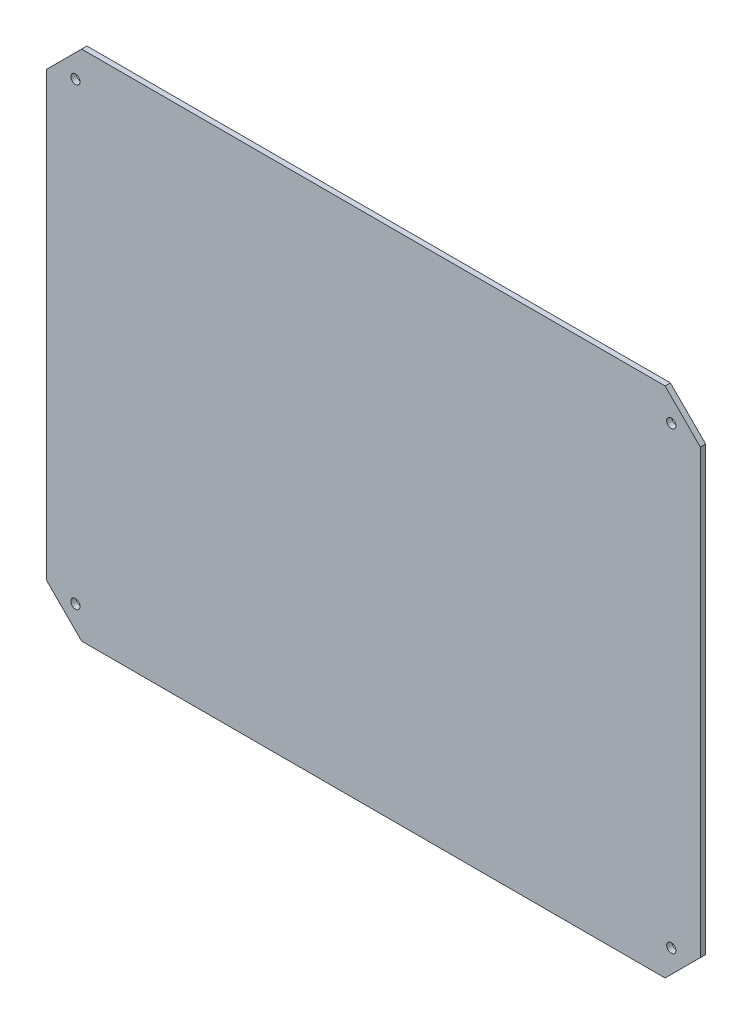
ISO-10303-21;
HEADER;
FILE_DESCRIPTION(('STEP AP214'),'2;1');
FILE_NAME('part.step','',(''),(''),'','','');
FILE_SCHEMA(('AUTOMOTIVE_DESIGN { 1 0 10303 214 1 1 1 1 }'));
ENDSEC;
DATA;
#1=APPLICATION_CONTEXT('core data for automotive mechanical design processes');
#2=APPLICATION_PROTOCOL_DEFINITION('international standard','automotive_design',2000,#1);
#3=PRODUCT_CONTEXT('',#1,'mechanical');
#4=PRODUCT('Part','Part','',(#3));
#5=PRODUCT_RELATED_PRODUCT_CATEGORY('part','',(#4));
#6=PRODUCT_DEFINITION_FORMATION('','',#4);
#7=PRODUCT_DEFINITION_CONTEXT('part definition',#1,'design');
#8=PRODUCT_DEFINITION('design','',#6,#7);
#9=PRODUCT_DEFINITION_SHAPE('','',#8);
#10=(LENGTH_UNIT() NAMED_UNIT(*) SI_UNIT(.MILLI.,.METRE.));
#11=(NAMED_UNIT(*) PLANE_ANGLE_UNIT() SI_UNIT($,.RADIAN.));
#12=(NAMED_UNIT(*) SI_UNIT($,.STERADIAN.) SOLID_ANGLE_UNIT());
#13=UNCERTAINTY_MEASURE_WITH_UNIT(LENGTH_MEASURE(1.E-05),#10,'distance_accuracy_value','');
#14=(GEOMETRIC_REPRESENTATION_CONTEXT(3) GLOBAL_UNCERTAINTY_ASSIGNED_CONTEXT((#13)) GLOBAL_UNIT_ASSIGNED_CONTEXT((#10,
#11,#12)) REPRESENTATION_CONTEXT('',''));
#15=CARTESIAN_POINT('',(0.,0.,0.));
#16=DIRECTION('',(0.,0.,1.));
#17=DIRECTION('',(1.,0.,0.));
#18=AXIS2_PLACEMENT_3D('',#15,#16,#17);
#19=CARTESIAN_POINT('',(0.,290.,3.));
#20=DIRECTION('',(1.,0.,0.));
#21=DIRECTION('',(0.,0.,-1.));
#22=AXIS2_PLACEMENT_3D('',#19,#20,#21);
#23=PLANE('',#22);
#24=DIRECTION('',(0.,-1.,0.));
#25=VECTOR('',#24,1.);
#26=CARTESIAN_POINT('',(0.,290.,3.));
#27=LINE('',#26,#25);
#28=CARTESIAN_POINT('',(0.,270.,3.));
#29=VERTEX_POINT('',#28);
#30=CARTESIAN_POINT('',(0.,20.0000000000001,3.));
#31=VERTEX_POINT('',#30);
#32=EDGE_CURVE('E128',#29,#31,#27,.T.);
#33=ORIENTED_EDGE('',*,*,#32,.F.);
#34=DIRECTION('',(0.,0.,-1.));
#35=VECTOR('',#34,1.);
#36=CARTESIAN_POINT('',(0.,270.,3.));
#37=LINE('',#36,#35);
#38=CARTESIAN_POINT('',(0.,270.,0.));
#39=VERTEX_POINT('',#38);
#40=EDGE_CURVE('E112',#29,#39,#37,.T.);
#41=ORIENTED_EDGE('',*,*,#40,.T.);
#42=DIRECTION('',(0.,-1.,0.));
#43=VECTOR('',#42,1.);
#44=CARTESIAN_POINT('',(0.,290.,0.));
#45=LINE('',#44,#43);
#46=CARTESIAN_POINT('',(0.,20.0000000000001,0.));
#47=VERTEX_POINT('',#46);
#48=EDGE_CURVE('E125',#39,#47,#45,.T.);
#49=ORIENTED_EDGE('',*,*,#48,.T.);
#50=DIRECTION('',(0.,0.,1.));
#51=VECTOR('',#50,1.);
#52=CARTESIAN_POINT('',(0.,20.0000000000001,3.));
#53=LINE('',#52,#51);
#54=EDGE_CURVE('E131',#47,#31,#53,.T.);
#55=ORIENTED_EDGE('',*,*,#54,.T.);
#56=EDGE_LOOP('',(#33,#41,#49,#55));
#57=FACE_BOUND('',#56,.T.);
#58=ADVANCED_FACE('F41',(#57),#23,.F.);
#59=CARTESIAN_POINT('',(0.,0.,3.));
#60=DIRECTION('',(0.,1.,0.));
#61=DIRECTION('',(0.,0.,1.));
#62=AXIS2_PLACEMENT_3D('',#59,#60,#61);
#63=PLANE('',#62);
#64=DIRECTION('',(1.,0.,0.));
#65=VECTOR('',#64,1.);
#66=CARTESIAN_POINT('',(0.,0.,3.));
#67=LINE('',#66,#65);
#68=CARTESIAN_POINT('',(20.,0.,3.));
#69=VERTEX_POINT('',#68);
#70=CARTESIAN_POINT('',(350.,0.,3.));
#71=VERTEX_POINT('',#70);
#72=EDGE_CURVE('E193',#69,#71,#67,.T.);
#73=ORIENTED_EDGE('',*,*,#72,.F.);
#74=DIRECTION('',(0.,0.,-1.));
#75=VECTOR('',#74,1.);
#76=CARTESIAN_POINT('',(20.,0.,3.));
#77=LINE('',#76,#75);
#78=CARTESIAN_POINT('',(20.,0.,0.));
#79=VERTEX_POINT('',#78);
#80=EDGE_CURVE('E184',#69,#79,#77,.T.);
#81=ORIENTED_EDGE('',*,*,#80,.T.);
#82=DIRECTION('',(1.,0.,0.));
#83=VECTOR('',#82,1.);
#84=CARTESIAN_POINT('',(0.,0.,0.));
#85=LINE('',#84,#83);
#86=CARTESIAN_POINT('',(350.,0.,0.));
#87=VERTEX_POINT('',#86);
#88=EDGE_CURVE('E136',#79,#87,#85,.T.);
#89=ORIENTED_EDGE('',*,*,#88,.T.);
#90=DIRECTION('',(0.,0.,1.));
#91=VECTOR('',#90,1.);
#92=CARTESIAN_POINT('',(350.,0.,3.));
#93=LINE('',#92,#91);
#94=EDGE_CURVE('E181',#87,#71,#93,.T.);
#95=ORIENTED_EDGE('',*,*,#94,.T.);
#96=EDGE_LOOP('',(#73,#81,#89,#95));
#97=FACE_BOUND('',#96,.T.);
#98=ADVANCED_FACE('F257',(#97),#63,.F.);
#99=CARTESIAN_POINT('',(370.,0.,3.));
#100=DIRECTION('',(-1.,0.,0.));
#101=DIRECTION('',(0.,0.,1.));
#102=AXIS2_PLACEMENT_3D('',#99,#100,#101);
#103=PLANE('',#102);
#104=DIRECTION('',(0.,1.,0.));
#105=VECTOR('',#104,1.);
#106=CARTESIAN_POINT('',(370.,0.,3.));
#107=LINE('',#106,#105);
#108=CARTESIAN_POINT('',(370.,20.,3.));
#109=VERTEX_POINT('',#108);
#110=CARTESIAN_POINT('',(370.,270.,3.));
#111=VERTEX_POINT('',#110);
#112=EDGE_CURVE('E191',#109,#111,#107,.T.);
#113=ORIENTED_EDGE('',*,*,#112,.F.);
#114=DIRECTION('',(0.,0.,-1.));
#115=VECTOR('',#114,1.);
#116=CARTESIAN_POINT('',(370.,20.,3.));
#117=LINE('',#116,#115);
#118=CARTESIAN_POINT('',(370.,20.,0.));
#119=VERTEX_POINT('',#118);
#120=EDGE_CURVE('E11',#109,#119,#117,.T.);
#121=ORIENTED_EDGE('',*,*,#120,.T.);
#122=DIRECTION('',(0.,1.,0.));
#123=VECTOR('',#122,1.);
#124=CARTESIAN_POINT('',(370.,0.,0.));
#125=LINE('',#124,#123);
#126=CARTESIAN_POINT('',(370.,270.,0.));
#127=VERTEX_POINT('',#126);
#128=EDGE_CURVE('E142',#119,#127,#125,.T.);
#129=ORIENTED_EDGE('',*,*,#128,.T.);
#130=DIRECTION('',(0.,0.,1.));
#131=VECTOR('',#130,1.);
#132=CARTESIAN_POINT('',(370.,270.,3.));
#133=LINE('',#132,#131);
#134=EDGE_CURVE('E50',#127,#111,#133,.T.);
#135=ORIENTED_EDGE('',*,*,#134,.T.);
#136=EDGE_LOOP('',(#113,#121,#129,#135));
#137=FACE_BOUND('',#136,.T.);
#138=ADVANCED_FACE('F250',(#137),#103,.F.);
#139=CARTESIAN_POINT('',(370.,290.,3.));
#140=DIRECTION('',(0.,-1.,0.));
#141=DIRECTION('',(1.,0.,0.));
#142=AXIS2_PLACEMENT_3D('',#139,#140,#141);
#143=PLANE('',#142);
#144=DIRECTION('',(-1.,0.,0.));
#145=VECTOR('',#144,1.);
#146=CARTESIAN_POINT('',(370.,290.,0.));
#147=LINE('',#146,#145);
#148=CARTESIAN_POINT('',(350.,290.,0.));
#149=VERTEX_POINT('',#148);
#150=CARTESIAN_POINT('',(20.0000000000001,290.,0.));
#151=VERTEX_POINT('',#150);
#152=EDGE_CURVE('E153',#149,#151,#147,.T.);
#153=ORIENTED_EDGE('',*,*,#152,.T.);
#154=DIRECTION('',(0.,0.,1.));
#155=VECTOR('',#154,1.);
#156=CARTESIAN_POINT('',(20.0000000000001,290.,3.));
#157=LINE('',#156,#155);
#158=CARTESIAN_POINT('',(20.0000000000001,290.,3.));
#159=VERTEX_POINT('',#158);
#160=EDGE_CURVE('E113',#151,#159,#157,.T.);
#161=ORIENTED_EDGE('',*,*,#160,.T.);
#162=DIRECTION('',(-1.,0.,0.));
#163=VECTOR('',#162,1.);
#164=CARTESIAN_POINT('',(370.,290.,3.));
#165=LINE('',#164,#163);
#166=CARTESIAN_POINT('',(350.,290.,3.));
#167=VERTEX_POINT('',#166);
#168=EDGE_CURVE('E148',#167,#159,#165,.T.);
#169=ORIENTED_EDGE('',*,*,#168,.F.);
#170=DIRECTION('',(0.,0.,-1.));
#171=VECTOR('',#170,1.);
#172=CARTESIAN_POINT('',(350.,290.,3.));
#173=LINE('',#172,#171);
#174=EDGE_CURVE('E119',#167,#149,#173,.T.);
#175=ORIENTED_EDGE('',*,*,#174,.T.);
#176=EDGE_LOOP('',(#153,#161,#169,#175));
#177=FACE_BOUND('',#176,.T.);
#178=ADVANCED_FACE('F240',(#177),#143,.F.);
#179=CARTESIAN_POINT('',(0.,0.,3.));
#180=DIRECTION('',(0.,0.,1.));
#181=DIRECTION('',(1.,0.,0.));
#182=AXIS2_PLACEMENT_3D('',#179,#180,#181);
#183=PLANE('',#182);
#184=CARTESIAN_POINT('',(16.4983113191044,16.4983113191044,3.));
#185=DIRECTION('',(0.,0.,1.));
#186=DIRECTION('',(1.,0.,0.));
#187=AXIS2_PLACEMENT_3D('',#184,#185,#186);
#188=CIRCLE('',#187,2.6);
#189=CARTESIAN_POINT('',(19.0983113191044,16.4983113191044,3.));
#190=VERTEX_POINT('',#189);
#191=EDGE_CURVE('E203',#190,#190,#188,.T.);
#192=ORIENTED_EDGE('',*,*,#191,.F.);
#193=EDGE_LOOP('',(#192));
#194=FACE_BOUND('',#193,.T.);
#195=CARTESIAN_POINT('',(16.4983113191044,273.501688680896,3.));
#196=DIRECTION('',(0.,0.,1.));
#197=DIRECTION('',(1.,0.,0.));
#198=AXIS2_PLACEMENT_3D('',#195,#196,#197);
#199=CIRCLE('',#198,2.6);
#200=CARTESIAN_POINT('',(19.0983113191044,273.501688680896,3.));
#201=VERTEX_POINT('',#200);
#202=EDGE_CURVE('E211',#201,#201,#199,.T.);
#203=ORIENTED_EDGE('',*,*,#202,.F.);
#204=EDGE_LOOP('',(#203));
#205=FACE_BOUND('',#204,.T.);
#206=CARTESIAN_POINT('',(353.501688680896,273.501688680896,3.));
#207=DIRECTION('',(0.,0.,1.));
#208=DIRECTION('',(1.,0.,0.));
#209=AXIS2_PLACEMENT_3D('',#206,#207,#208);
#210=CIRCLE('',#209,2.60000000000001);
#211=CARTESIAN_POINT('',(356.101688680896,273.501688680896,3.));
#212=VERTEX_POINT('',#211);
#213=EDGE_CURVE('E219',#212,#212,#210,.T.);
#214=ORIENTED_EDGE('',*,*,#213,.F.);
#215=EDGE_LOOP('',(#214));
#216=FACE_BOUND('',#215,.T.);
#217=CARTESIAN_POINT('',(353.501688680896,16.4983113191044,3.));
#218=DIRECTION('',(0.,0.,1.));
#219=DIRECTION('',(1.,0.,0.));
#220=AXIS2_PLACEMENT_3D('',#217,#218,#219);
#221=CIRCLE('',#220,2.60000000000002);
#222=CARTESIAN_POINT('',(356.101688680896,16.4983113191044,3.));
#223=VERTEX_POINT('',#222);
#224=EDGE_CURVE('E145',#223,#223,#221,.T.);
#225=ORIENTED_EDGE('',*,*,#224,.F.);
#226=EDGE_LOOP('',(#225));
#227=FACE_BOUND('',#226,.T.);
#228=ORIENTED_EDGE('',*,*,#168,.T.);
#229=DIRECTION('',(0.707106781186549,0.707106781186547,0.));
#230=VECTOR('',#229,1.);
#231=CARTESIAN_POINT('',(-135.,135.,3.));
#232=LINE('',#231,#230);
#233=EDGE_CURVE('E178',#159,#29,#232,.F.);
#234=ORIENTED_EDGE('',*,*,#233,.T.);
#235=ORIENTED_EDGE('',*,*,#32,.T.);
#236=DIRECTION('',(-0.707106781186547,0.707106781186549,0.));
#237=VECTOR('',#236,1.);
#238=CARTESIAN_POINT('',(10.,10.,3.));
#239=LINE('',#238,#237);
#240=EDGE_CURVE('E175',#31,#69,#239,.F.);
#241=ORIENTED_EDGE('',*,*,#240,.T.);
#242=ORIENTED_EDGE('',*,*,#72,.T.);
#243=DIRECTION('',(-0.707106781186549,-0.707106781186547,0.));
#244=VECTOR('',#243,1.);
#245=CARTESIAN_POINT('',(174.999999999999,-175.,3.));
#246=LINE('',#245,#244);
#247=EDGE_CURVE('E63',#71,#109,#246,.F.);
#248=ORIENTED_EDGE('',*,*,#247,.T.);
#249=ORIENTED_EDGE('',*,*,#112,.T.);
#250=DIRECTION('',(0.707106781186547,-0.707106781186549,0.));
#251=VECTOR('',#250,1.);
#252=CARTESIAN_POINT('',(320.,320.,3.));
#253=LINE('',#252,#251);
#254=EDGE_CURVE('E170',#111,#167,#253,.F.);
#255=ORIENTED_EDGE('',*,*,#254,.T.);
#256=EDGE_LOOP('',(#228,#234,#235,#241,#242,#248,#249,#255));
#257=FACE_BOUND('',#256,.T.);
#258=ADVANCED_FACE('F237',(#194,#205,#216,#227,#257),#183,.T.);
#259=CARTESIAN_POINT('',(0.,0.,0.));
#260=DIRECTION('',(0.,0.,1.));
#261=DIRECTION('',(1.,0.,0.));
#262=AXIS2_PLACEMENT_3D('',#259,#260,#261);
#263=PLANE('',#262);
#264=CARTESIAN_POINT('',(16.4983113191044,16.4983113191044,0.));
#265=DIRECTION('',(0.,0.,1.));
#266=DIRECTION('',(1.,0.,0.));
#267=AXIS2_PLACEMENT_3D('',#264,#265,#266);
#268=CIRCLE('',#267,2.6);
#269=CARTESIAN_POINT('',(19.0983113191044,16.4983113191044,0.));
#270=VERTEX_POINT('',#269);
#271=EDGE_CURVE('E207',#270,#270,#268,.T.);
#272=ORIENTED_EDGE('',*,*,#271,.T.);
#273=EDGE_LOOP('',(#272));
#274=FACE_BOUND('',#273,.T.);
#275=CARTESIAN_POINT('',(16.4983113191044,273.501688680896,0.));
#276=DIRECTION('',(0.,0.,1.));
#277=DIRECTION('',(1.,0.,0.));
#278=AXIS2_PLACEMENT_3D('',#275,#276,#277);
#279=CIRCLE('',#278,2.6);
#280=CARTESIAN_POINT('',(19.0983113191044,273.501688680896,0.));
#281=VERTEX_POINT('',#280);
#282=EDGE_CURVE('E215',#281,#281,#279,.T.);
#283=ORIENTED_EDGE('',*,*,#282,.T.);
#284=EDGE_LOOP('',(#283));
#285=FACE_BOUND('',#284,.T.);
#286=CARTESIAN_POINT('',(353.501688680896,273.501688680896,0.));
#287=DIRECTION('',(0.,0.,1.));
#288=DIRECTION('',(1.,0.,0.));
#289=AXIS2_PLACEMENT_3D('',#286,#287,#288);
#290=CIRCLE('',#289,2.60000000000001);
#291=CARTESIAN_POINT('',(356.101688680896,273.501688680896,0.));
#292=VERTEX_POINT('',#291);
#293=EDGE_CURVE('E201',#292,#292,#290,.T.);
#294=ORIENTED_EDGE('',*,*,#293,.T.);
#295=EDGE_LOOP('',(#294));
#296=FACE_BOUND('',#295,.T.);
#297=CARTESIAN_POINT('',(353.501688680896,16.4983113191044,0.));
#298=DIRECTION('',(0.,0.,1.));
#299=DIRECTION('',(1.,0.,0.));
#300=AXIS2_PLACEMENT_3D('',#297,#298,#299);
#301=CIRCLE('',#300,2.60000000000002);
#302=CARTESIAN_POINT('',(356.101688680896,16.4983113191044,0.));
#303=VERTEX_POINT('',#302);
#304=EDGE_CURVE('E137',#303,#303,#301,.T.);
#305=ORIENTED_EDGE('',*,*,#304,.T.);
#306=EDGE_LOOP('',(#305));
#307=FACE_BOUND('',#306,.T.);
#308=ORIENTED_EDGE('',*,*,#48,.F.);
#309=DIRECTION('',(-0.707106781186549,-0.707106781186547,0.));
#310=VECTOR('',#309,1.);
#311=CARTESIAN_POINT('',(0.,270.,0.));
#312=LINE('',#311,#310);
#313=EDGE_CURVE('E108',#39,#151,#312,.F.);
#314=ORIENTED_EDGE('',*,*,#313,.T.);
#315=ORIENTED_EDGE('',*,*,#152,.F.);
#316=DIRECTION('',(-0.707106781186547,0.707106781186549,0.));
#317=VECTOR('',#316,1.);
#318=CARTESIAN_POINT('',(350.,290.,0.));
#319=LINE('',#318,#317);
#320=EDGE_CURVE('E130',#149,#127,#319,.F.);
#321=ORIENTED_EDGE('',*,*,#320,.T.);
#322=ORIENTED_EDGE('',*,*,#128,.F.);
#323=DIRECTION('',(0.707106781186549,0.707106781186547,0.));
#324=VECTOR('',#323,1.);
#325=CARTESIAN_POINT('',(370.,20.,0.));
#326=LINE('',#325,#324);
#327=EDGE_CURVE('E160',#119,#87,#326,.F.);
#328=ORIENTED_EDGE('',*,*,#327,.T.);
#329=ORIENTED_EDGE('',*,*,#88,.F.);
#330=DIRECTION('',(0.707106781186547,-0.707106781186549,0.));
#331=VECTOR('',#330,1.);
#332=CARTESIAN_POINT('',(20.,0.,0.));
#333=LINE('',#332,#331);
#334=EDGE_CURVE('E120',#79,#47,#333,.F.);
#335=ORIENTED_EDGE('',*,*,#334,.T.);
#336=EDGE_LOOP('',(#308,#314,#315,#321,#322,#328,#329,#335));
#337=FACE_BOUND('',#336,.T.);
#338=ADVANCED_FACE('F133',(#274,#285,#296,#307,#337),#263,.F.);
#339=CARTESIAN_POINT('',(0.,270.,3.));
#340=DIRECTION('',(0.707106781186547,-0.707106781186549,0.));
#341=DIRECTION('',(0.,0.,-1.));
#342=AXIS2_PLACEMENT_3D('',#339,#340,#341);
#343=PLANE('',#342);
#344=ORIENTED_EDGE('',*,*,#233,.F.);
#345=ORIENTED_EDGE('',*,*,#160,.F.);
#346=ORIENTED_EDGE('',*,*,#313,.F.);
#347=ORIENTED_EDGE('',*,*,#40,.F.);
#348=EDGE_LOOP('',(#344,#345,#346,#347));
#349=FACE_BOUND('',#348,.T.);
#350=ADVANCED_FACE('F111',(#349),#343,.F.);
#351=CARTESIAN_POINT('',(20.,0.,3.));
#352=DIRECTION('',(0.707106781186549,0.707106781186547,0.));
#353=DIRECTION('',(0.,0.,-1.));
#354=AXIS2_PLACEMENT_3D('',#351,#352,#353);
#355=PLANE('',#354);
#356=ORIENTED_EDGE('',*,*,#240,.F.);
#357=ORIENTED_EDGE('',*,*,#54,.F.);
#358=ORIENTED_EDGE('',*,*,#334,.F.);
#359=ORIENTED_EDGE('',*,*,#80,.F.);
#360=EDGE_LOOP('',(#356,#357,#358,#359));
#361=FACE_BOUND('',#360,.T.);
#362=ADVANCED_FACE('F260',(#361),#355,.F.);
#363=CARTESIAN_POINT('',(370.,20.,3.));
#364=DIRECTION('',(-0.707106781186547,0.707106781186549,0.));
#365=DIRECTION('',(0.,0.,-1.));
#366=AXIS2_PLACEMENT_3D('',#363,#364,#365);
#367=PLANE('',#366);
#368=ORIENTED_EDGE('',*,*,#247,.F.);
#369=ORIENTED_EDGE('',*,*,#94,.F.);
#370=ORIENTED_EDGE('',*,*,#327,.F.);
#371=ORIENTED_EDGE('',*,*,#120,.F.);
#372=EDGE_LOOP('',(#368,#369,#370,#371));
#373=FACE_BOUND('',#372,.T.);
#374=ADVANCED_FACE('F253',(#373),#367,.F.);
#375=CARTESIAN_POINT('',(350.,290.,3.));
#376=DIRECTION('',(-0.707106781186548,-0.707106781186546,0.));
#377=DIRECTION('',(0.,0.,-1.));
#378=AXIS2_PLACEMENT_3D('',#375,#376,#377);
#379=PLANE('',#378);
#380=ORIENTED_EDGE('',*,*,#254,.F.);
#381=ORIENTED_EDGE('',*,*,#134,.F.);
#382=ORIENTED_EDGE('',*,*,#320,.F.);
#383=ORIENTED_EDGE('',*,*,#174,.F.);
#384=EDGE_LOOP('',(#380,#381,#382,#383));
#385=FACE_BOUND('',#384,.T.);
#386=ADVANCED_FACE('F43',(#385),#379,.F.);
#387=CARTESIAN_POINT('',(353.501688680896,16.4983113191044,0.));
#388=DIRECTION('',(0.,0.,1.));
#389=DIRECTION('',(1.,0.,0.));
#390=AXIS2_PLACEMENT_3D('',#387,#388,#389);
#391=CYLINDRICAL_SURFACE('',#390,2.60000000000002);
#392=ORIENTED_EDGE('',*,*,#304,.F.);
#393=EDGE_LOOP('',(#392));
#394=FACE_BOUND('',#393,.T.);
#395=ORIENTED_EDGE('',*,*,#224,.T.);
#396=EDGE_LOOP('',(#395));
#397=FACE_BOUND('',#396,.T.);
#398=ADVANCED_FACE('F233',(#394,#397),#391,.F.);
#399=CARTESIAN_POINT('',(353.501688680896,273.501688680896,0.));
#400=DIRECTION('',(0.,0.,1.));
#401=DIRECTION('',(1.,0.,0.));
#402=AXIS2_PLACEMENT_3D('',#399,#400,#401);
#403=CYLINDRICAL_SURFACE('',#402,2.60000000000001);
#404=ORIENTED_EDGE('',*,*,#293,.F.);
#405=EDGE_LOOP('',(#404));
#406=FACE_BOUND('',#405,.T.);
#407=ORIENTED_EDGE('',*,*,#213,.T.);
#408=EDGE_LOOP('',(#407));
#409=FACE_BOUND('',#408,.T.);
#410=ADVANCED_FACE('F229',(#406,#409),#403,.F.);
#411=CARTESIAN_POINT('',(16.4983113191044,273.501688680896,0.));
#412=DIRECTION('',(0.,0.,1.));
#413=DIRECTION('',(1.,0.,0.));
#414=AXIS2_PLACEMENT_3D('',#411,#412,#413);
#415=CYLINDRICAL_SURFACE('',#414,2.6);
#416=ORIENTED_EDGE('',*,*,#282,.F.);
#417=EDGE_LOOP('',(#416));
#418=FACE_BOUND('',#417,.T.);
#419=ORIENTED_EDGE('',*,*,#202,.T.);
#420=EDGE_LOOP('',(#419));
#421=FACE_BOUND('',#420,.T.);
#422=ADVANCED_FACE('F232',(#418,#421),#415,.F.);
#423=CARTESIAN_POINT('',(16.4983113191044,16.4983113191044,0.));
#424=DIRECTION('',(0.,0.,1.));
#425=DIRECTION('',(1.,0.,0.));
#426=AXIS2_PLACEMENT_3D('',#423,#424,#425);
#427=CYLINDRICAL_SURFACE('',#426,2.6);
#428=ORIENTED_EDGE('',*,*,#271,.F.);
#429=EDGE_LOOP('',(#428));
#430=FACE_BOUND('',#429,.T.);
#431=ORIENTED_EDGE('',*,*,#191,.T.);
#432=EDGE_LOOP('',(#431));
#433=FACE_BOUND('',#432,.T.);
#434=ADVANCED_FACE('F285',(#430,#433),#427,.F.);
#435=CLOSED_SHELL('',(#58,#98,#138,#178,#258,#338,#350,#362,#374,#386,#398,#410,#422,#434));
#436=MANIFOLD_SOLID_BREP('B2',#435);
#437=ADVANCED_BREP_SHAPE_REPRESENTATION('',(#18,#436),#14);
#438=SHAPE_DEFINITION_REPRESENTATION(#9,#437);
ENDSEC;
END-ISO-10303-21;
